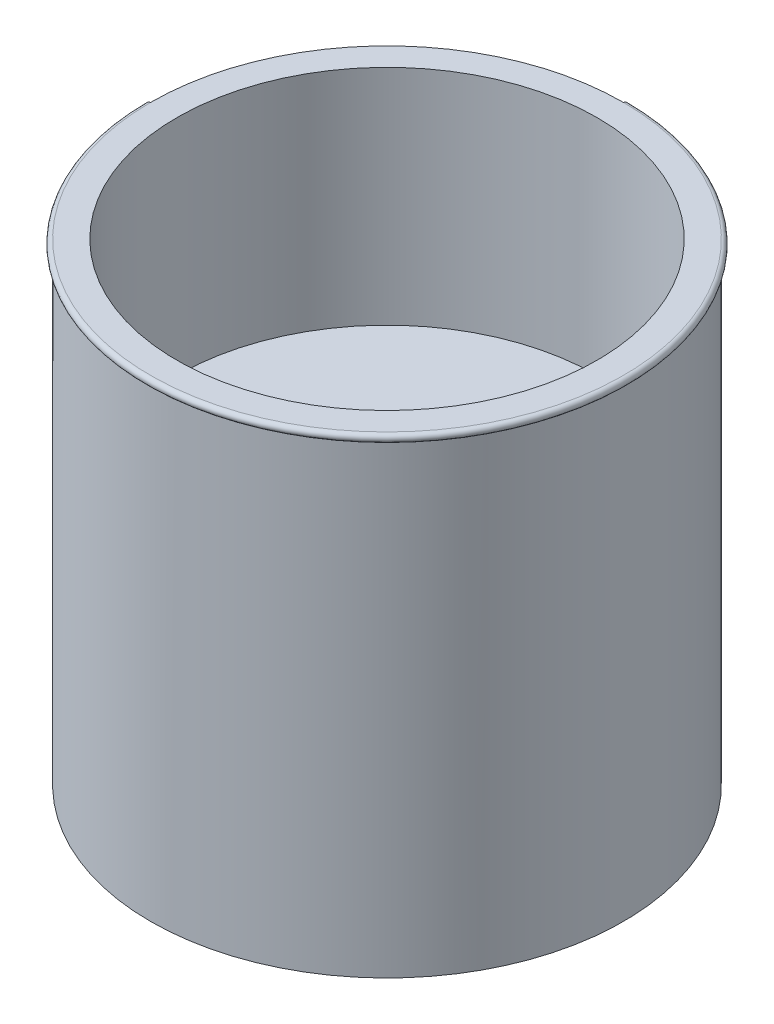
ISO-10303-21;
HEADER;
FILE_DESCRIPTION(('STEP AP214'),'2;1');
FILE_NAME('part.step','',(''),(''),'','','');
FILE_SCHEMA(('AUTOMOTIVE_DESIGN { 1 0 10303 214 1 1 1 1 }'));
ENDSEC;
DATA;
#1=APPLICATION_CONTEXT('core data for automotive mechanical design processes');
#2=APPLICATION_PROTOCOL_DEFINITION('international standard','automotive_design',2000,#1);
#3=PRODUCT_CONTEXT('',#1,'mechanical');
#4=PRODUCT('Part','Part','',(#3));
#5=PRODUCT_RELATED_PRODUCT_CATEGORY('part','',(#4));
#6=PRODUCT_DEFINITION_FORMATION('','',#4);
#7=PRODUCT_DEFINITION_CONTEXT('part definition',#1,'design');
#8=PRODUCT_DEFINITION('design','',#6,#7);
#9=PRODUCT_DEFINITION_SHAPE('','',#8);
#10=(LENGTH_UNIT() NAMED_UNIT(*) SI_UNIT(.MILLI.,.METRE.));
#11=(NAMED_UNIT(*) PLANE_ANGLE_UNIT() SI_UNIT($,.RADIAN.));
#12=(NAMED_UNIT(*) SI_UNIT($,.STERADIAN.) SOLID_ANGLE_UNIT());
#13=UNCERTAINTY_MEASURE_WITH_UNIT(LENGTH_MEASURE(1.E-05),#10,'distance_accuracy_value','');
#14=(GEOMETRIC_REPRESENTATION_CONTEXT(3) GLOBAL_UNCERTAINTY_ASSIGNED_CONTEXT((#13)) GLOBAL_UNIT_ASSIGNED_CONTEXT((#10,
#11,#12)) REPRESENTATION_CONTEXT('',''));
#15=CARTESIAN_POINT('',(0.,0.,0.));
#16=DIRECTION('',(0.,0.,1.));
#17=DIRECTION('',(1.,0.,0.));
#18=AXIS2_PLACEMENT_3D('',#15,#16,#17);
#19=CARTESIAN_POINT('',(-228.6,228.6,0.));
#20=DIRECTION('',(0.,-1.,0.));
#21=DIRECTION('',(0.,0.,-1.));
#22=AXIS2_PLACEMENT_3D('',#19,#20,#21);
#23=PLANE('',#22);
#24=CARTESIAN_POINT('',(0.,228.6,0.));
#25=DIRECTION('',(0.,-1.,0.));
#26=DIRECTION('',(0.,0.,-1.));
#27=AXIS2_PLACEMENT_3D('',#24,#25,#26);
#28=CIRCLE('',#27,228.6);
#29=CARTESIAN_POINT('',(0.,228.6,-228.6));
#30=VERTEX_POINT('',#29);
#31=CARTESIAN_POINT('',(-228.6,228.6,0.));
#32=VERTEX_POINT('',#31);
#33=EDGE_CURVE('E69',#30,#32,#28,.T.);
#34=ORIENTED_EDGE('',*,*,#33,.F.);
#35=EDGE_CURVE('E72',#32,#30,#28,.T.);
#36=ORIENTED_EDGE('',*,*,#35,.F.);
#37=EDGE_LOOP('',(#34,#36));
#38=FACE_BOUND('',#37,.T.);
#39=CARTESIAN_POINT('',(0.,228.6,0.));
#40=DIRECTION('',(0.,-1.,0.));
#41=DIRECTION('',(0.,0.,-1.));
#42=AXIS2_PLACEMENT_3D('',#39,#40,#41);
#43=CIRCLE('',#42,203.2);
#44=CARTESIAN_POINT('',(0.,228.6,-203.2));
#45=VERTEX_POINT('',#44);
#46=EDGE_CURVE('E64',#45,#45,#43,.T.);
#47=ORIENTED_EDGE('',*,*,#46,.T.);
#48=EDGE_LOOP('',(#47));
#49=FACE_BOUND('',#48,.T.);
#50=ADVANCED_FACE('F33',(#38,#49),#23,.F.);
#51=CARTESIAN_POINT('',(0.,0.,0.));
#52=DIRECTION('',(0.,-1.,0.));
#53=DIRECTION('',(0.,0.,-1.));
#54=AXIS2_PLACEMENT_3D('',#51,#52,#53);
#55=CYLINDRICAL_SURFACE('',#54,203.2);
#56=ORIENTED_EDGE('',*,*,#46,.F.);
#57=EDGE_LOOP('',(#56));
#58=FACE_BOUND('',#57,.T.);
#59=CARTESIAN_POINT('',(0.,12.7,0.));
#60=DIRECTION('',(0.,-1.,0.));
#61=DIRECTION('',(0.,0.,-1.));
#62=AXIS2_PLACEMENT_3D('',#59,#60,#61);
#63=CIRCLE('',#62,203.2);
#64=CARTESIAN_POINT('',(0.,12.7,-203.2));
#65=VERTEX_POINT('',#64);
#66=EDGE_CURVE('E85',#65,#65,#63,.T.);
#67=ORIENTED_EDGE('',*,*,#66,.T.);
#68=EDGE_LOOP('',(#67));
#69=FACE_BOUND('',#68,.T.);
#70=ADVANCED_FACE('F92',(#58,#69),#55,.F.);
#71=CARTESIAN_POINT('',(-203.2,12.7,0.));
#72=DIRECTION('',(0.,-1.,0.));
#73=DIRECTION('',(0.,0.,-1.));
#74=AXIS2_PLACEMENT_3D('',#71,#72,#73);
#75=PLANE('',#74);
#76=ORIENTED_EDGE('',*,*,#66,.F.);
#77=EDGE_LOOP('',(#76));
#78=FACE_BOUND('',#77,.T.);
#79=ADVANCED_FACE('F95',(#78),#75,.F.);
#80=CARTESIAN_POINT('',(-203.2,-12.7,0.));
#81=DIRECTION('',(0.,1.,0.));
#82=DIRECTION('',(0.,0.,1.));
#83=AXIS2_PLACEMENT_3D('',#80,#81,#82);
#84=PLANE('',#83);
#85=CARTESIAN_POINT('',(0.,-12.7,0.));
#86=DIRECTION('',(0.,-1.,0.));
#87=DIRECTION('',(0.,0.,-1.));
#88=AXIS2_PLACEMENT_3D('',#85,#86,#87);
#89=CIRCLE('',#88,203.2);
#90=CARTESIAN_POINT('',(0.,-12.7,-203.2));
#91=VERTEX_POINT('',#90);
#92=EDGE_CURVE('E82',#91,#91,#89,.T.);
#93=ORIENTED_EDGE('',*,*,#92,.T.);
#94=EDGE_LOOP('',(#93));
#95=FACE_BOUND('',#94,.T.);
#96=ADVANCED_FACE('F99',(#95),#84,.F.);
#97=CARTESIAN_POINT('',(0.,0.,0.));
#98=DIRECTION('',(0.,-1.,0.));
#99=DIRECTION('',(0.,0.,-1.));
#100=AXIS2_PLACEMENT_3D('',#97,#98,#99);
#101=CYLINDRICAL_SURFACE('',#100,203.2);
#102=ORIENTED_EDGE('',*,*,#92,.F.);
#103=EDGE_LOOP('',(#102));
#104=FACE_BOUND('',#103,.T.);
#105=CARTESIAN_POINT('',(0.,-228.6,0.));
#106=DIRECTION('',(0.,-1.,0.));
#107=DIRECTION('',(0.,0.,-1.));
#108=AXIS2_PLACEMENT_3D('',#105,#106,#107);
#109=CIRCLE('',#108,203.2);
#110=CARTESIAN_POINT('',(0.,-228.6,-203.2));
#111=VERTEX_POINT('',#110);
#112=EDGE_CURVE('E79',#111,#111,#109,.T.);
#113=ORIENTED_EDGE('',*,*,#112,.T.);
#114=EDGE_LOOP('',(#113));
#115=FACE_BOUND('',#114,.T.);
#116=ADVANCED_FACE('F104',(#104,#115),#101,.F.);
#117=CARTESIAN_POINT('',(-228.6,-228.6,0.));
#118=DIRECTION('',(0.,1.,0.));
#119=DIRECTION('',(0.,0.,1.));
#120=AXIS2_PLACEMENT_3D('',#117,#118,#119);
#121=PLANE('',#120);
#122=ORIENTED_EDGE('',*,*,#112,.F.);
#123=EDGE_LOOP('',(#122));
#124=FACE_BOUND('',#123,.T.);
#125=CARTESIAN_POINT('',(0.,-228.6,0.));
#126=DIRECTION('',(0.,-1.,0.));
#127=DIRECTION('',(0.,0.,-1.));
#128=AXIS2_PLACEMENT_3D('',#125,#126,#127);
#129=CIRCLE('',#128,228.6);
#130=CARTESIAN_POINT('',(0.,-228.6,-228.6));
#131=VERTEX_POINT('',#130);
#132=EDGE_CURVE('E76',#131,#131,#129,.T.);
#133=ORIENTED_EDGE('',*,*,#132,.T.);
#134=EDGE_LOOP('',(#133));
#135=FACE_BOUND('',#134,.T.);
#136=ADVANCED_FACE('F124',(#124,#135),#121,.F.);
#137=CARTESIAN_POINT('',(0.,0.,0.));
#138=DIRECTION('',(0.,-1.,0.));
#139=DIRECTION('',(0.,0.,-1.));
#140=AXIS2_PLACEMENT_3D('',#137,#138,#139);
#141=CYLINDRICAL_SURFACE('',#140,228.6);
#142=ORIENTED_EDGE('',*,*,#132,.F.);
#143=EDGE_LOOP('',(#142));
#144=FACE_BOUND('',#143,.T.);
#145=ORIENTED_EDGE('',*,*,#35,.T.);
#146=DIRECTION('',(0.,-1.,0.));
#147=VECTOR('',#146,1.);
#148=CARTESIAN_POINT('',(-2.39445928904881E-12,0.,-228.6));
#149=LINE('',#148,#147);
#150=CARTESIAN_POINT('',(-2.39445928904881E-12,220.6625,-228.6));
#151=VERTEX_POINT('',#150);
#152=EDGE_CURVE('E11',#30,#151,#149,.T.);
#153=ORIENTED_EDGE('',*,*,#152,.T.);
#154=CARTESIAN_POINT('',(0.,220.6625,0.));
#155=DIRECTION('',(0.,1.,0.));
#156=DIRECTION('',(0.,0.,1.));
#157=AXIS2_PLACEMENT_3D('',#154,#155,#156);
#158=CIRCLE('',#157,228.6);
#159=CARTESIAN_POINT('',(-228.6,220.6625,0.));
#160=VERTEX_POINT('',#159);
#161=EDGE_CURVE('E40',#160,#151,#158,.T.);
#162=ORIENTED_EDGE('',*,*,#161,.F.);
#163=DIRECTION('',(0.,-1.,0.));
#164=VECTOR('',#163,1.);
#165=CARTESIAN_POINT('',(-228.6,0.,0.));
#166=LINE('',#165,#164);
#167=EDGE_CURVE('E50',#32,#160,#166,.T.);
#168=ORIENTED_EDGE('',*,*,#167,.F.);
#169=EDGE_LOOP('',(#145,#153,#162,#168));
#170=FACE_BOUND('',#169,.T.);
#171=ADVANCED_FACE('F55',(#144,#170),#141,.T.);
#172=CARTESIAN_POINT('',(0.,224.63125,0.));
#173=DIRECTION('',(0.,-1.,0.));
#174=DIRECTION('',(0.,0.,-1.));
#175=AXIS2_PLACEMENT_3D('',#172,#173,#174);
#176=TOROIDAL_SURFACE('',#175,228.6,3.96875000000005);
#177=CARTESIAN_POINT('',(-228.6,224.63125,0.));
#178=DIRECTION('',(0.,0.,1.));
#179=DIRECTION('',(1.,0.,0.));
#180=AXIS2_PLACEMENT_3D('',#177,#178,#179);
#181=CIRCLE('',#180,3.96875000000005);
#182=EDGE_CURVE('E63',#32,#160,#181,.T.);
#183=ORIENTED_EDGE('',*,*,#182,.T.);
#184=ORIENTED_EDGE('',*,*,#161,.T.);
#185=CARTESIAN_POINT('',(-2.39445928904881E-12,224.63125,-228.6));
#186=DIRECTION('',(-1.,0.,0.));
#187=DIRECTION('',(0.,0.,1.));
#188=AXIS2_PLACEMENT_3D('',#185,#186,#187);
#189=CIRCLE('',#188,3.96875000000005);
#190=EDGE_CURVE('E70',#30,#151,#189,.T.);
#191=ORIENTED_EDGE('',*,*,#190,.F.);
#192=ORIENTED_EDGE('',*,*,#33,.T.);
#193=EDGE_LOOP('',(#183,#184,#191,#192));
#194=FACE_BOUND('',#193,.T.);
#195=ADVANCED_FACE('F67',(#194),#176,.T.);
#196=CARTESIAN_POINT('',(-2.39445928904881E-12,224.63125,-228.6));
#197=DIRECTION('',(-1.,0.,0.));
#198=DIRECTION('',(0.,0.,1.));
#199=AXIS2_PLACEMENT_3D('',#196,#197,#198);
#200=PLANE('',#199);
#201=ORIENTED_EDGE('',*,*,#152,.F.);
#202=ORIENTED_EDGE('',*,*,#190,.T.);
#203=EDGE_LOOP('',(#201,#202));
#204=FACE_BOUND('',#203,.T.);
#205=ADVANCED_FACE('F112',(#204),#200,.T.);
#206=CARTESIAN_POINT('',(-228.6,224.63125,0.));
#207=DIRECTION('',(0.,0.,1.));
#208=DIRECTION('',(1.,0.,0.));
#209=AXIS2_PLACEMENT_3D('',#206,#207,#208);
#210=PLANE('',#209);
#211=ORIENTED_EDGE('',*,*,#182,.F.);
#212=ORIENTED_EDGE('',*,*,#167,.T.);
#213=EDGE_LOOP('',(#211,#212));
#214=FACE_BOUND('',#213,.T.);
#215=ADVANCED_FACE('F62',(#214),#210,.F.);
#216=CLOSED_SHELL('',(#50,#70,#79,#96,#116,#136,#171,#195,#205,#215));
#217=MANIFOLD_SOLID_BREP('B2',#216);
#218=ADVANCED_BREP_SHAPE_REPRESENTATION('',(#18,#217),#14);
#219=SHAPE_DEFINITION_REPRESENTATION(#9,#218);
ENDSEC;
END-ISO-10303-21;
